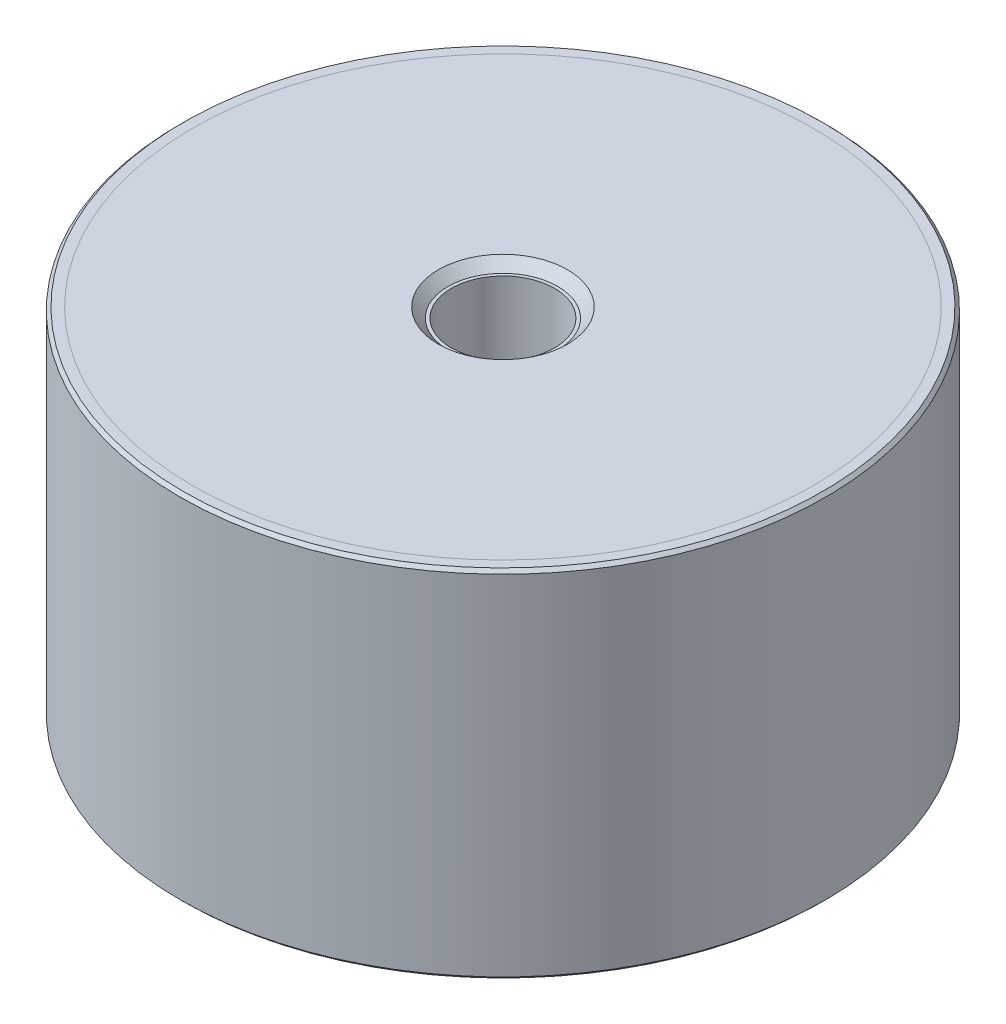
ISO-10303-21;
HEADER;
FILE_DESCRIPTION(('STEP AP214'),'2;1');
FILE_NAME('part.step','',(''),(''),'','','');
FILE_SCHEMA(('AUTOMOTIVE_DESIGN { 1 0 10303 214 1 1 1 1 }'));
ENDSEC;
DATA;
#1=APPLICATION_CONTEXT('core data for automotive mechanical design processes');
#2=APPLICATION_PROTOCOL_DEFINITION('international standard','automotive_design',2000,#1);
#3=PRODUCT_CONTEXT('',#1,'mechanical');
#4=PRODUCT('Part','Part','',(#3));
#5=PRODUCT_RELATED_PRODUCT_CATEGORY('part','',(#4));
#6=PRODUCT_DEFINITION_FORMATION('','',#4);
#7=PRODUCT_DEFINITION_CONTEXT('part definition',#1,'design');
#8=PRODUCT_DEFINITION('design','',#6,#7);
#9=PRODUCT_DEFINITION_SHAPE('','',#8);
#10=(LENGTH_UNIT() NAMED_UNIT(*) SI_UNIT(.MILLI.,.METRE.));
#11=(NAMED_UNIT(*) PLANE_ANGLE_UNIT() SI_UNIT($,.RADIAN.));
#12=(NAMED_UNIT(*) SI_UNIT($,.STERADIAN.) SOLID_ANGLE_UNIT());
#13=UNCERTAINTY_MEASURE_WITH_UNIT(LENGTH_MEASURE(1.E-05),#10,'distance_accuracy_value','');
#14=(GEOMETRIC_REPRESENTATION_CONTEXT(3) GLOBAL_UNCERTAINTY_ASSIGNED_CONTEXT((#13)) GLOBAL_UNIT_ASSIGNED_CONTEXT((#10,
#11,#12)) REPRESENTATION_CONTEXT('',''));
#15=CARTESIAN_POINT('',(0.,0.,0.));
#16=DIRECTION('',(0.,0.,1.));
#17=DIRECTION('',(1.,0.,0.));
#18=AXIS2_PLACEMENT_3D('',#15,#16,#17);
#19=CARTESIAN_POINT('',(0.,-52.,8.));
#20=DIRECTION('',(0.,1.,0.));
#21=DIRECTION('',(0.,0.,1.));
#22=AXIS2_PLACEMENT_3D('',#19,#20,#21);
#23=PLANE('',#22);
#24=CARTESIAN_POINT('',(0.,-52.,0.));
#25=DIRECTION('',(0.,1.,0.));
#26=DIRECTION('',(0.,0.,1.));
#27=AXIS2_PLACEMENT_3D('',#24,#25,#26);
#28=CIRCLE('',#27,8.50000000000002);
#29=CARTESIAN_POINT('',(0.,-52.,8.50000000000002));
#30=VERTEX_POINT('',#29);
#31=EDGE_CURVE('P0_E10',#30,#30,#28,.F.);
#32=ORIENTED_EDGE('',*,*,#31,.T.);
#33=EDGE_LOOP('',(#32));
#34=FACE_BOUND('',#33,.T.);
#35=CARTESIAN_POINT('',(0.,-52.,0.));
#36=DIRECTION('',(0.,1.,0.));
#37=DIRECTION('',(0.,0.,1.));
#38=AXIS2_PLACEMENT_3D('',#35,#36,#37);
#39=CIRCLE('',#38,48.);
#40=CARTESIAN_POINT('',(0.,-52.,48.));
#41=VERTEX_POINT('',#40);
#42=EDGE_CURVE('P0_E25',#41,#41,#39,.T.);
#43=ORIENTED_EDGE('',*,*,#42,.T.);
#44=EDGE_LOOP('',(#43));
#45=FACE_BOUND('',#44,.T.);
#46=ADVANCED_FACE('P0_F14',(#34,#45),#23,.T.);
#47=CARTESIAN_POINT('',(0.,16.0340428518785,0.));
#48=DIRECTION('',(0.,1.,0.));
#49=DIRECTION('',(0.,0.,1.));
#50=AXIS2_PLACEMENT_3D('',#47,#48,#49);
#51=CYLINDRICAL_SURFACE('',#50,48.);
#52=CARTESIAN_POINT('',(0.,-53.5,0.));
#53=DIRECTION('',(0.,1.,0.));
#54=DIRECTION('',(0.,0.,1.));
#55=AXIS2_PLACEMENT_3D('',#52,#53,#54);
#56=CIRCLE('',#55,48.);
#57=CARTESIAN_POINT('',(0.,-53.5,48.));
#58=VERTEX_POINT('',#57);
#59=EDGE_CURVE('P0_E29',#58,#58,#56,.T.);
#60=ORIENTED_EDGE('',*,*,#59,.T.);
#61=EDGE_LOOP('',(#60));
#62=FACE_BOUND('',#61,.T.);
#63=ORIENTED_EDGE('',*,*,#42,.F.);
#64=EDGE_LOOP('',(#63));
#65=FACE_BOUND('',#64,.T.);
#66=ADVANCED_FACE('P0_F35',(#62,#65),#51,.T.);
#67=CARTESIAN_POINT('',(0.,-53.5,48.));
#68=DIRECTION('',(0.,-1.,0.));
#69=DIRECTION('',(0.,0.,-1.));
#70=AXIS2_PLACEMENT_3D('',#67,#68,#69);
#71=PLANE('',#70);
#72=CARTESIAN_POINT('',(0.,-53.5,0.));
#73=DIRECTION('',(0.,-1.,0.));
#74=DIRECTION('',(0.,0.,-1.));
#75=AXIS2_PLACEMENT_3D('',#72,#73,#74);
#76=CIRCLE('',#75,10.);
#77=CARTESIAN_POINT('',(0.,-53.5,-10.));
#78=VERTEX_POINT('',#77);
#79=EDGE_CURVE('P0_E21',#78,#78,#76,.F.);
#80=ORIENTED_EDGE('',*,*,#79,.T.);
#81=EDGE_LOOP('',(#80));
#82=FACE_BOUND('',#81,.T.);
#83=ORIENTED_EDGE('',*,*,#59,.F.);
#84=EDGE_LOOP('',(#83));
#85=FACE_BOUND('',#84,.T.);
#86=ADVANCED_FACE('P0_F38',(#82,#85),#71,.T.);
#87=CARTESIAN_POINT('',(0.,-53.5,0.));
#88=DIRECTION('',(0.,-1.,0.));
#89=DIRECTION('',(0.,0.,-1.));
#90=AXIS2_PLACEMENT_3D('',#87,#88,#89);
#91=CONICAL_SURFACE('',#90,10.,0.785398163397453);
#92=ORIENTED_EDGE('',*,*,#31,.F.);
#93=EDGE_LOOP('',(#92));
#94=FACE_BOUND('',#93,.T.);
#95=ORIENTED_EDGE('',*,*,#79,.F.);
#96=EDGE_LOOP('',(#95));
#97=FACE_BOUND('',#96,.T.);
#98=ADVANCED_FACE('P0_F16',(#94,#97),#91,.F.);
#99=CLOSED_SHELL('',(#46,#66,#86,#98));
#100=MANIFOLD_SOLID_BREP('P0_B1',#99);
#101=CARTESIAN_POINT('',(0.,1.5,8.));
#102=DIRECTION('',(0.,1.,0.));
#103=DIRECTION('',(0.,0.,1.));
#104=AXIS2_PLACEMENT_3D('',#101,#102,#103);
#105=PLANE('',#104);
#106=CARTESIAN_POINT('',(0.,1.5,0.));
#107=DIRECTION('',(0.,1.,0.));
#108=DIRECTION('',(0.,0.,1.));
#109=AXIS2_PLACEMENT_3D('',#106,#107,#108);
#110=CIRCLE('',#109,10.);
#111=CARTESIAN_POINT('',(0.,1.5,10.));
#112=VERTEX_POINT('',#111);
#113=EDGE_CURVE('P1_E10',#112,#112,#110,.F.);
#114=ORIENTED_EDGE('',*,*,#113,.T.);
#115=EDGE_LOOP('',(#114));
#116=FACE_BOUND('',#115,.T.);
#117=CARTESIAN_POINT('',(0.,1.5,0.));
#118=DIRECTION('',(0.,1.,0.));
#119=DIRECTION('',(0.,0.,1.));
#120=AXIS2_PLACEMENT_3D('',#117,#118,#119);
#121=CIRCLE('',#120,48.);
#122=CARTESIAN_POINT('',(0.,1.5,48.));
#123=VERTEX_POINT('',#122);
#124=EDGE_CURVE('P1_E25',#123,#123,#121,.T.);
#125=ORIENTED_EDGE('',*,*,#124,.T.);
#126=EDGE_LOOP('',(#125));
#127=FACE_BOUND('',#126,.T.);
#128=ADVANCED_FACE('P1_F14',(#116,#127),#105,.T.);
#129=CARTESIAN_POINT('',(0.,69.5340428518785,0.));
#130=DIRECTION('',(0.,1.,0.));
#131=DIRECTION('',(0.,0.,1.));
#132=AXIS2_PLACEMENT_3D('',#129,#130,#131);
#133=CYLINDRICAL_SURFACE('',#132,48.);
#134=CARTESIAN_POINT('',(0.,0.,0.));
#135=DIRECTION('',(0.,1.,0.));
#136=DIRECTION('',(0.,0.,1.));
#137=AXIS2_PLACEMENT_3D('',#134,#135,#136);
#138=CIRCLE('',#137,48.);
#139=CARTESIAN_POINT('',(0.,0.,48.));
#140=VERTEX_POINT('',#139);
#141=EDGE_CURVE('P1_E29',#140,#140,#138,.T.);
#142=ORIENTED_EDGE('',*,*,#141,.T.);
#143=EDGE_LOOP('',(#142));
#144=FACE_BOUND('',#143,.T.);
#145=ORIENTED_EDGE('',*,*,#124,.F.);
#146=EDGE_LOOP('',(#145));
#147=FACE_BOUND('',#146,.T.);
#148=ADVANCED_FACE('P1_F35',(#144,#147),#133,.T.);
#149=CARTESIAN_POINT('',(0.,0.,48.));
#150=DIRECTION('',(0.,-1.,0.));
#151=DIRECTION('',(0.,0.,-1.));
#152=AXIS2_PLACEMENT_3D('',#149,#150,#151);
#153=PLANE('',#152);
#154=CARTESIAN_POINT('',(0.,0.,0.));
#155=DIRECTION('',(0.,-1.,0.));
#156=DIRECTION('',(0.,0.,-1.));
#157=AXIS2_PLACEMENT_3D('',#154,#155,#156);
#158=CIRCLE('',#157,8.50000000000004);
#159=CARTESIAN_POINT('',(0.,0.,-8.50000000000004));
#160=VERTEX_POINT('',#159);
#161=EDGE_CURVE('P1_E21',#160,#160,#158,.F.);
#162=ORIENTED_EDGE('',*,*,#161,.T.);
#163=EDGE_LOOP('',(#162));
#164=FACE_BOUND('',#163,.T.);
#165=ORIENTED_EDGE('',*,*,#141,.F.);
#166=EDGE_LOOP('',(#165));
#167=FACE_BOUND('',#166,.T.);
#168=ADVANCED_FACE('P1_F38',(#164,#167),#153,.T.);
#169=CARTESIAN_POINT('',(0.,-0.500000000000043,0.));
#170=DIRECTION('',(0.,1.,0.));
#171=DIRECTION('',(0.,0.,1.));
#172=AXIS2_PLACEMENT_3D('',#169,#170,#171);
#173=CONICAL_SURFACE('',#172,8.,0.785398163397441);
#174=ORIENTED_EDGE('',*,*,#113,.F.);
#175=EDGE_LOOP('',(#174));
#176=FACE_BOUND('',#175,.T.);
#177=ORIENTED_EDGE('',*,*,#161,.F.);
#178=EDGE_LOOP('',(#177));
#179=FACE_BOUND('',#178,.T.);
#180=ADVANCED_FACE('P1_F16',(#176,#179),#173,.F.);
#181=CLOSED_SHELL('',(#128,#148,#168,#180));
#182=MANIFOLD_SOLID_BREP('P1_B1',#181);
#183=CARTESIAN_POINT('',(0.,0.,0.));
#184=DIRECTION('',(0.,1.,0.));
#185=DIRECTION('',(0.,0.,1.));
#186=AXIS2_PLACEMENT_3D('',#183,#184,#185);
#187=PLANE('',#186);
#188=CARTESIAN_POINT('',(0.,0.,0.));
#189=DIRECTION('',(0.,1.,0.));
#190=DIRECTION('',(0.,0.,1.));
#191=AXIS2_PLACEMENT_3D('',#188,#189,#190);
#192=CIRCLE('',#191,8.);
#193=CARTESIAN_POINT('',(0.,0.,8.));
#194=VERTEX_POINT('',#193);
#195=EDGE_CURVE('P2_E46',#194,#194,#192,.T.);
#196=ORIENTED_EDGE('',*,*,#195,.F.);
#197=EDGE_LOOP('',(#196));
#198=FACE_BOUND('',#197,.T.);
#199=CARTESIAN_POINT('',(0.,0.,0.));
#200=DIRECTION('',(0.,1.,0.));
#201=DIRECTION('',(0.,0.,1.));
#202=AXIS2_PLACEMENT_3D('',#199,#200,#201);
#203=CIRCLE('',#202,48.);
#204=CARTESIAN_POINT('',(0.,0.,48.));
#205=VERTEX_POINT('',#204);
#206=EDGE_CURVE('P2_E33',#205,#205,#203,.T.);
#207=ORIENTED_EDGE('',*,*,#206,.T.);
#208=EDGE_LOOP('',(#207));
#209=FACE_BOUND('',#208,.T.);
#210=ADVANCED_FACE('P2_F13',(#198,#209),#187,.T.);
#211=CARTESIAN_POINT('',(0.,65.5134936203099,0.));
#212=DIRECTION('',(0.,1.,0.));
#213=DIRECTION('',(0.,0.,1.));
#214=AXIS2_PLACEMENT_3D('',#211,#212,#213);
#215=CYLINDRICAL_SURFACE('',#214,48.);
#216=CARTESIAN_POINT('',(0.,1.49999999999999,0.));
#217=DIRECTION('',(0.,1.,0.));
#218=DIRECTION('',(0.,0.,1.));
#219=AXIS2_PLACEMENT_3D('',#216,#217,#218);
#220=CIRCLE('',#219,48.);
#221=CARTESIAN_POINT('',(0.,1.49999999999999,48.));
#222=VERTEX_POINT('',#221);
#223=EDGE_CURVE('P2_E36',#222,#222,#220,.T.);
#224=ORIENTED_EDGE('',*,*,#223,.T.);
#225=EDGE_LOOP('',(#224));
#226=FACE_BOUND('',#225,.T.);
#227=ORIENTED_EDGE('',*,*,#206,.F.);
#228=EDGE_LOOP('',(#227));
#229=FACE_BOUND('',#228,.T.);
#230=ADVANCED_FACE('P2_F92',(#226,#229),#215,.F.);
#231=CARTESIAN_POINT('',(0.,1.49999999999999,48.));
#232=DIRECTION('',(0.,1.,0.));
#233=DIRECTION('',(0.,0.,1.));
#234=AXIS2_PLACEMENT_3D('',#231,#232,#233);
#235=PLANE('',#234);
#236=CARTESIAN_POINT('',(0.,1.49999999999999,0.));
#237=DIRECTION('',(0.,1.,0.));
#238=DIRECTION('',(0.,0.,1.));
#239=AXIS2_PLACEMENT_3D('',#236,#237,#238);
#240=CIRCLE('',#239,49.5);
#241=CARTESIAN_POINT('',(0.,1.49999999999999,49.5));
#242=VERTEX_POINT('',#241);
#243=EDGE_CURVE('P2_E9',#242,#242,#240,.T.);
#244=ORIENTED_EDGE('',*,*,#243,.T.);
#245=EDGE_LOOP('',(#244));
#246=FACE_BOUND('',#245,.T.);
#247=ORIENTED_EDGE('',*,*,#223,.F.);
#248=EDGE_LOOP('',(#247));
#249=FACE_BOUND('',#248,.T.);
#250=ADVANCED_FACE('P2_F88',(#246,#249),#235,.T.);
#251=CARTESIAN_POINT('',(0.,65.5134936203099,0.));
#252=DIRECTION('',(0.,1.,0.));
#253=DIRECTION('',(0.,0.,1.));
#254=AXIS2_PLACEMENT_3D('',#251,#252,#253);
#255=CYLINDRICAL_SURFACE('',#254,50.);
#256=CARTESIAN_POINT('',(0.,-53.,0.));
#257=DIRECTION('',(0.,-1.,0.));
#258=DIRECTION('',(0.,0.,-1.));
#259=AXIS2_PLACEMENT_3D('',#256,#257,#258);
#260=CIRCLE('',#259,50.);
#261=CARTESIAN_POINT('',(0.,-53.,-50.));
#262=VERTEX_POINT('',#261);
#263=EDGE_CURVE('P2_E24',#262,#262,#260,.F.);
#264=ORIENTED_EDGE('',*,*,#263,.T.);
#265=EDGE_LOOP('',(#264));
#266=FACE_BOUND('',#265,.T.);
#267=CARTESIAN_POINT('',(0.,0.999999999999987,0.));
#268=DIRECTION('',(0.,1.,0.));
#269=DIRECTION('',(0.,0.,1.));
#270=AXIS2_PLACEMENT_3D('',#267,#268,#269);
#271=CIRCLE('',#270,50.);
#272=CARTESIAN_POINT('',(0.,0.999999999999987,50.));
#273=VERTEX_POINT('',#272);
#274=EDGE_CURVE('P2_E28',#273,#273,#271,.F.);
#275=ORIENTED_EDGE('',*,*,#274,.T.);
#276=EDGE_LOOP('',(#275));
#277=FACE_BOUND('',#276,.T.);
#278=ADVANCED_FACE('P2_F82',(#266,#277),#255,.T.);
#279=CARTESIAN_POINT('',(0.,-53.5,50.));
#280=DIRECTION('',(0.,-1.,0.));
#281=DIRECTION('',(0.,0.,-1.));
#282=AXIS2_PLACEMENT_3D('',#279,#280,#281);
#283=PLANE('',#282);
#284=CARTESIAN_POINT('',(0.,-53.5,0.));
#285=DIRECTION('',(0.,-1.,0.));
#286=DIRECTION('',(0.,0.,-1.));
#287=AXIS2_PLACEMENT_3D('',#284,#285,#286);
#288=CIRCLE('',#287,49.5);
#289=CARTESIAN_POINT('',(0.,-53.5,-49.5));
#290=VERTEX_POINT('',#289);
#291=EDGE_CURVE('P2_E20',#290,#290,#288,.T.);
#292=ORIENTED_EDGE('',*,*,#291,.T.);
#293=EDGE_LOOP('',(#292));
#294=FACE_BOUND('',#293,.T.);
#295=CARTESIAN_POINT('',(0.,-53.5,0.));
#296=DIRECTION('',(0.,1.,0.));
#297=DIRECTION('',(0.,0.,1.));
#298=AXIS2_PLACEMENT_3D('',#295,#296,#297);
#299=CIRCLE('',#298,48.);
#300=CARTESIAN_POINT('',(0.,-53.5,48.));
#301=VERTEX_POINT('',#300);
#302=EDGE_CURVE('P2_E39',#301,#301,#299,.T.);
#303=ORIENTED_EDGE('',*,*,#302,.T.);
#304=EDGE_LOOP('',(#303));
#305=FACE_BOUND('',#304,.T.);
#306=ADVANCED_FACE('P2_F77',(#294,#305),#283,.T.);
#307=CARTESIAN_POINT('',(0.,65.5134936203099,0.));
#308=DIRECTION('',(0.,1.,0.));
#309=DIRECTION('',(0.,0.,1.));
#310=AXIS2_PLACEMENT_3D('',#307,#308,#309);
#311=CYLINDRICAL_SURFACE('',#310,48.);
#312=CARTESIAN_POINT('',(0.,-52.,0.));
#313=DIRECTION('',(0.,1.,0.));
#314=DIRECTION('',(0.,0.,1.));
#315=AXIS2_PLACEMENT_3D('',#312,#313,#314);
#316=CIRCLE('',#315,48.);
#317=CARTESIAN_POINT('',(0.,-52.,48.));
#318=VERTEX_POINT('',#317);
#319=EDGE_CURVE('P2_E42',#318,#318,#316,.T.);
#320=ORIENTED_EDGE('',*,*,#319,.T.);
#321=EDGE_LOOP('',(#320));
#322=FACE_BOUND('',#321,.T.);
#323=ORIENTED_EDGE('',*,*,#302,.F.);
#324=EDGE_LOOP('',(#323));
#325=FACE_BOUND('',#324,.T.);
#326=ADVANCED_FACE('P2_F71',(#322,#325),#311,.F.);
#327=CARTESIAN_POINT('',(0.,-52.,48.));
#328=DIRECTION('',(0.,-1.,0.));
#329=DIRECTION('',(0.,0.,-1.));
#330=AXIS2_PLACEMENT_3D('',#327,#328,#329);
#331=PLANE('',#330);
#332=CARTESIAN_POINT('',(0.,-52.,0.));
#333=DIRECTION('',(0.,-1.,0.));
#334=DIRECTION('',(0.,0.,-1.));
#335=AXIS2_PLACEMENT_3D('',#332,#333,#334);
#336=CIRCLE('',#335,8.);
#337=CARTESIAN_POINT('',(0.,-52.,-8.));
#338=VERTEX_POINT('',#337);
#339=EDGE_CURVE('P2_E52',#338,#338,#336,.T.);
#340=ORIENTED_EDGE('',*,*,#339,.F.);
#341=EDGE_LOOP('',(#340));
#342=FACE_BOUND('',#341,.T.);
#343=ORIENTED_EDGE('',*,*,#319,.F.);
#344=EDGE_LOOP('',(#343));
#345=FACE_BOUND('',#344,.T.);
#346=ADVANCED_FACE('P2_F67',(#342,#345),#331,.T.);
#347=CARTESIAN_POINT('',(0.,-53.,0.));
#348=DIRECTION('',(0.,1.,0.));
#349=DIRECTION('',(0.,0.,1.));
#350=AXIS2_PLACEMENT_3D('',#347,#348,#349);
#351=CONICAL_SURFACE('',#350,50.,0.785398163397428);
#352=ORIENTED_EDGE('',*,*,#291,.F.);
#353=EDGE_LOOP('',(#352));
#354=FACE_BOUND('',#353,.T.);
#355=ORIENTED_EDGE('',*,*,#263,.F.);
#356=EDGE_LOOP('',(#355));
#357=FACE_BOUND('',#356,.T.);
#358=ADVANCED_FACE('P2_F70',(#354,#357),#351,.T.);
#359=CARTESIAN_POINT('',(0.,1.49999999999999,0.));
#360=DIRECTION('',(0.,-1.,0.));
#361=DIRECTION('',(0.,0.,-1.));
#362=AXIS2_PLACEMENT_3D('',#359,#360,#361);
#363=CONICAL_SURFACE('',#362,49.5,0.785398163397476);
#364=ORIENTED_EDGE('',*,*,#274,.F.);
#365=EDGE_LOOP('',(#364));
#366=FACE_BOUND('',#365,.T.);
#367=ORIENTED_EDGE('',*,*,#243,.F.);
#368=EDGE_LOOP('',(#367));
#369=FACE_BOUND('',#368,.T.);
#370=ADVANCED_FACE('P2_F15',(#366,#369),#363,.T.);
#371=CARTESIAN_POINT('',(0.,-14.5,0.));
#372=DIRECTION('',(0.,1.,0.));
#373=DIRECTION('',(0.,0.,1.));
#374=AXIS2_PLACEMENT_3D('',#371,#372,#373);
#375=CYLINDRICAL_SURFACE('',#374,8.);
#376=CARTESIAN_POINT('',(0.,-14.5,0.));
#377=DIRECTION('',(0.,1.,0.));
#378=DIRECTION('',(0.,0.,1.));
#379=AXIS2_PLACEMENT_3D('',#376,#377,#378);
#380=CIRCLE('',#379,8.);
#381=CARTESIAN_POINT('',(0.,-14.5,8.));
#382=VERTEX_POINT('',#381);
#383=EDGE_CURVE('P2_E45',#382,#382,#380,.T.);
#384=CARTESIAN_POINT('',(0.,-14.5,8.));
#385=CARTESIAN_POINT('',(0.,-14.3489583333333,8.));
#386=CARTESIAN_POINT('',(0.,-14.1979166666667,8.));
#387=CARTESIAN_POINT('',(0.,-13.8958333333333,8.));
#388=CARTESIAN_POINT('',(0.,-13.7447916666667,8.));
#389=CARTESIAN_POINT('',(0.,-13.4427083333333,8.));
#390=CARTESIAN_POINT('',(0.,-13.2916666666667,8.));
#391=CARTESIAN_POINT('',(0.,-12.9895833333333,8.));
#392=CARTESIAN_POINT('',(0.,-12.8385416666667,8.));
#393=CARTESIAN_POINT('',(0.,-12.5364583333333,8.));
#394=CARTESIAN_POINT('',(0.,-12.3854166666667,8.));
#395=CARTESIAN_POINT('',(0.,-12.0833333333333,8.));
#396=CARTESIAN_POINT('',(0.,-11.9322916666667,8.));
#397=CARTESIAN_POINT('',(0.,-11.6302083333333,8.));
#398=CARTESIAN_POINT('',(0.,-11.4791666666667,8.));
#399=CARTESIAN_POINT('',(0.,-11.1770833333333,8.));
#400=CARTESIAN_POINT('',(0.,-11.0260416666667,8.));
#401=CARTESIAN_POINT('',(0.,-10.7239583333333,8.));
#402=CARTESIAN_POINT('',(0.,-10.5729166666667,8.));
#403=CARTESIAN_POINT('',(0.,-10.2708333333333,8.));
#404=CARTESIAN_POINT('',(0.,-10.1197916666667,8.));
#405=CARTESIAN_POINT('',(0.,-9.81770833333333,8.));
#406=CARTESIAN_POINT('',(0.,-9.66666666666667,8.));
#407=CARTESIAN_POINT('',(0.,-9.36458333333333,8.));
#408=CARTESIAN_POINT('',(0.,-9.21354166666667,8.));
#409=CARTESIAN_POINT('',(0.,-8.91145833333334,8.));
#410=CARTESIAN_POINT('',(0.,-8.76041666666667,8.));
#411=CARTESIAN_POINT('',(0.,-8.45833333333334,8.));
#412=CARTESIAN_POINT('',(0.,-8.30729166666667,8.));
#413=CARTESIAN_POINT('',(0.,-8.00520833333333,8.));
#414=CARTESIAN_POINT('',(0.,-7.85416666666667,8.));
#415=CARTESIAN_POINT('',(0.,-7.55208333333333,8.));
#416=CARTESIAN_POINT('',(0.,-7.40104166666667,8.));
#417=CARTESIAN_POINT('',(0.,-7.09895833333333,8.));
#418=CARTESIAN_POINT('',(0.,-6.94791666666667,8.));
#419=CARTESIAN_POINT('',(0.,-6.64583333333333,8.));
#420=CARTESIAN_POINT('',(0.,-6.49479166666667,8.));
#421=CARTESIAN_POINT('',(0.,-6.19270833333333,8.));
#422=CARTESIAN_POINT('',(0.,-6.04166666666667,8.));
#423=CARTESIAN_POINT('',(0.,-5.73958333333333,8.));
#424=CARTESIAN_POINT('',(0.,-5.58854166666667,8.));
#425=CARTESIAN_POINT('',(0.,-5.28645833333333,8.));
#426=CARTESIAN_POINT('',(0.,-5.13541666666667,8.));
#427=CARTESIAN_POINT('',(0.,-4.83333333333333,8.));
#428=CARTESIAN_POINT('',(0.,-4.68229166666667,8.));
#429=CARTESIAN_POINT('',(0.,-4.38020833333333,8.));
#430=CARTESIAN_POINT('',(0.,-4.22916666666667,8.));
#431=CARTESIAN_POINT('',(0.,-3.92708333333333,8.));
#432=CARTESIAN_POINT('',(0.,-3.77604166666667,8.));
#433=CARTESIAN_POINT('',(0.,-3.47395833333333,8.));
#434=CARTESIAN_POINT('',(0.,-3.32291666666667,8.));
#435=CARTESIAN_POINT('',(0.,-3.02083333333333,8.));
#436=CARTESIAN_POINT('',(0.,-2.86979166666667,8.));
#437=CARTESIAN_POINT('',(0.,-2.56770833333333,8.));
#438=CARTESIAN_POINT('',(0.,-2.41666666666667,8.));
#439=CARTESIAN_POINT('',(0.,-2.11458333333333,8.));
#440=CARTESIAN_POINT('',(0.,-1.96354166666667,8.));
#441=CARTESIAN_POINT('',(0.,-1.66145833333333,8.));
#442=CARTESIAN_POINT('',(0.,-1.51041666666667,8.));
#443=CARTESIAN_POINT('',(0.,-1.20833333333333,8.));
#444=CARTESIAN_POINT('',(0.,-1.05729166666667,8.));
#445=CARTESIAN_POINT('',(0.,-0.755208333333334,8.));
#446=CARTESIAN_POINT('',(0.,-0.604166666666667,8.));
#447=CARTESIAN_POINT('',(0.,-0.302083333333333,8.));
#448=CARTESIAN_POINT('',(0.,-0.151041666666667,8.));
#449=CARTESIAN_POINT('',(0.,0.,8.));
#450=B_SPLINE_CURVE_WITH_KNOTS('',3,(#384,#385,#386,#387,#388,#389,#390,#391,#392,#393,#394,
#395,#396,#397,#398,#399,#400,#401,#402,#403,#404,#405,#406,#407,#408,#409,#410,#411,#412,#413,
#414,#415,#416,#417,#418,#419,#420,#421,#422,#423,#424,#425,#426,#427,#428,#429,#430,#431,#432,
#433,#434,#435,#436,#437,#438,#439,#440,#441,#442,#443,#444,#445,#446,#447,#448,#449),
.UNSPECIFIED.,.F.,.F.,(4,2,2,2,2,2,2,2,2,2,2,2,2,2,2,2,2,2,2,2,2,2,2,2,2,2,2,2,2,2,2,2,4),(0.,
0.453124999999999,0.906249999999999,1.359375,1.8125,2.265625,2.71875,3.171875,3.625,4.078125,
4.53125,4.984375,5.4375,5.890625,6.34375,6.796875,7.25,7.703125,8.15625,8.609375,9.0625,
9.515625,9.96875,10.421875,10.875,11.328125,11.78125,12.234375,12.6875,13.140625,13.59375,
14.046875,14.5),.UNSPECIFIED.);
#451=EDGE_CURVE('P2_BSEAM108',#382,#194,#450,.T.);
#452=ORIENTED_EDGE('',*,*,#383,.F.);
#453=ORIENTED_EDGE('',*,*,#195,.T.);
#454=ORIENTED_EDGE('',*,*,#451,.T.);
#455=ORIENTED_EDGE('',*,*,#451,.F.);
#456=EDGE_LOOP('',(#452,#454,#453,#455));
#457=FACE_BOUND('',#456,.T.);
#458=ADVANCED_FACE('P2_F108',(#457),#375,.F.);
#459=CARTESIAN_POINT('',(0.,-14.5,0.));
#460=DIRECTION('',(0.,1.,0.));
#461=DIRECTION('',(0.,0.,1.));
#462=AXIS2_PLACEMENT_3D('',#459,#460,#461);
#463=PLANE('',#462);
#464=ORIENTED_EDGE('',*,*,#383,.T.);
#465=EDGE_LOOP('',(#464));
#466=FACE_BOUND('',#465,.T.);
#467=ADVANCED_FACE('P2_F63',(#466),#463,.T.);
#468=CARTESIAN_POINT('',(0.,-37.5,0.));
#469=DIRECTION('',(0.,-1.,0.));
#470=DIRECTION('',(0.,0.,-1.));
#471=AXIS2_PLACEMENT_3D('',#468,#469,#470);
#472=CYLINDRICAL_SURFACE('',#471,8.);
#473=CARTESIAN_POINT('',(0.,-37.5,0.));
#474=DIRECTION('',(0.,-1.,0.));
#475=DIRECTION('',(0.,0.,-1.));
#476=AXIS2_PLACEMENT_3D('',#473,#474,#475);
#477=CIRCLE('',#476,8.);
#478=CARTESIAN_POINT('',(0.,-37.5,-8.));
#479=VERTEX_POINT('',#478);
#480=EDGE_CURVE('P2_E49',#479,#479,#477,.T.);
#481=CARTESIAN_POINT('',(0.,-37.5,-8.));
#482=CARTESIAN_POINT('',(0.,-37.6510416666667,-8.));
#483=CARTESIAN_POINT('',(0.,-37.8020833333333,-8.));
#484=CARTESIAN_POINT('',(0.,-38.1041666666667,-8.));
#485=CARTESIAN_POINT('',(0.,-38.2552083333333,-8.));
#486=CARTESIAN_POINT('',(0.,-38.5572916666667,-8.));
#487=CARTESIAN_POINT('',(0.,-38.7083333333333,-8.));
#488=CARTESIAN_POINT('',(0.,-39.0104166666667,-8.));
#489=CARTESIAN_POINT('',(0.,-39.1614583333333,-8.));
#490=CARTESIAN_POINT('',(0.,-39.4635416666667,-8.));
#491=CARTESIAN_POINT('',(0.,-39.6145833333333,-8.));
#492=CARTESIAN_POINT('',(0.,-39.9166666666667,-8.));
#493=CARTESIAN_POINT('',(0.,-40.0677083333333,-8.));
#494=CARTESIAN_POINT('',(0.,-40.3697916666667,-8.));
#495=CARTESIAN_POINT('',(0.,-40.5208333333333,-8.));
#496=CARTESIAN_POINT('',(0.,-40.8229166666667,-8.));
#497=CARTESIAN_POINT('',(0.,-40.9739583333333,-8.));
#498=CARTESIAN_POINT('',(0.,-41.2760416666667,-8.));
#499=CARTESIAN_POINT('',(0.,-41.4270833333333,-8.));
#500=CARTESIAN_POINT('',(0.,-41.7291666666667,-8.));
#501=CARTESIAN_POINT('',(0.,-41.8802083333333,-8.));
#502=CARTESIAN_POINT('',(0.,-42.1822916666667,-8.));
#503=CARTESIAN_POINT('',(0.,-42.3333333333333,-8.));
#504=CARTESIAN_POINT('',(0.,-42.6354166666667,-8.));
#505=CARTESIAN_POINT('',(0.,-42.7864583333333,-8.));
#506=CARTESIAN_POINT('',(0.,-43.0885416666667,-8.));
#507=CARTESIAN_POINT('',(0.,-43.2395833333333,-8.));
#508=CARTESIAN_POINT('',(0.,-43.5416666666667,-8.));
#509=CARTESIAN_POINT('',(0.,-43.6927083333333,-8.));
#510=CARTESIAN_POINT('',(0.,-43.9947916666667,-8.));
#511=CARTESIAN_POINT('',(0.,-44.1458333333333,-8.));
#512=CARTESIAN_POINT('',(0.,-44.4479166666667,-8.));
#513=CARTESIAN_POINT('',(0.,-44.5989583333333,-8.));
#514=CARTESIAN_POINT('',(0.,-44.9010416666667,-8.));
#515=CARTESIAN_POINT('',(0.,-45.0520833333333,-8.));
#516=CARTESIAN_POINT('',(0.,-45.3541666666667,-8.));
#517=CARTESIAN_POINT('',(0.,-45.5052083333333,-8.));
#518=CARTESIAN_POINT('',(0.,-45.8072916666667,-8.));
#519=CARTESIAN_POINT('',(0.,-45.9583333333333,-8.));
#520=CARTESIAN_POINT('',(0.,-46.2604166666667,-8.));
#521=CARTESIAN_POINT('',(0.,-46.4114583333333,-8.));
#522=CARTESIAN_POINT('',(0.,-46.7135416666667,-8.));
#523=CARTESIAN_POINT('',(0.,-46.8645833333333,-8.));
#524=CARTESIAN_POINT('',(0.,-47.1666666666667,-8.));
#525=CARTESIAN_POINT('',(0.,-47.3177083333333,-8.));
#526=CARTESIAN_POINT('',(0.,-47.6197916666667,-8.));
#527=CARTESIAN_POINT('',(0.,-47.7708333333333,-8.));
#528=CARTESIAN_POINT('',(0.,-48.0729166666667,-8.));
#529=CARTESIAN_POINT('',(0.,-48.2239583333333,-8.));
#530=CARTESIAN_POINT('',(0.,-48.5260416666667,-8.));
#531=CARTESIAN_POINT('',(0.,-48.6770833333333,-8.));
#532=CARTESIAN_POINT('',(0.,-48.9791666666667,-8.));
#533=CARTESIAN_POINT('',(0.,-49.1302083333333,-8.));
#534=CARTESIAN_POINT('',(0.,-49.4322916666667,-8.));
#535=CARTESIAN_POINT('',(0.,-49.5833333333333,-8.));
#536=CARTESIAN_POINT('',(0.,-49.8854166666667,-8.));
#537=CARTESIAN_POINT('',(0.,-50.0364583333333,-8.));
#538=CARTESIAN_POINT('',(0.,-50.3385416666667,-8.));
#539=CARTESIAN_POINT('',(0.,-50.4895833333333,-8.));
#540=CARTESIAN_POINT('',(0.,-50.7916666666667,-8.));
#541=CARTESIAN_POINT('',(0.,-50.9427083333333,-8.));
#542=CARTESIAN_POINT('',(0.,-51.2447916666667,-8.));
#543=CARTESIAN_POINT('',(0.,-51.3958333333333,-8.));
#544=CARTESIAN_POINT('',(0.,-51.6979166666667,-8.));
#545=CARTESIAN_POINT('',(0.,-51.8489583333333,-8.));
#546=CARTESIAN_POINT('',(0.,-52.,-8.));
#547=B_SPLINE_CURVE_WITH_KNOTS('',3,(#481,#482,#483,#484,#485,#486,#487,#488,#489,#490,#491,
#492,#493,#494,#495,#496,#497,#498,#499,#500,#501,#502,#503,#504,#505,#506,#507,#508,#509,#510,
#511,#512,#513,#514,#515,#516,#517,#518,#519,#520,#521,#522,#523,#524,#525,#526,#527,#528,#529,
#530,#531,#532,#533,#534,#535,#536,#537,#538,#539,#540,#541,#542,#543,#544,#545,#546),
.UNSPECIFIED.,.F.,.F.,(4,2,2,2,2,2,2,2,2,2,2,2,2,2,2,2,2,2,2,2,2,2,2,2,2,2,2,2,2,2,2,2,4),(0.,
0.453125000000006,0.906250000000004,1.359375,1.8125,2.265625,2.71875000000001,3.171875,3.625,
4.078125,4.53125,4.984375,5.4375,5.890625,6.34375,6.796875,7.25,7.70312500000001,8.15625,
8.609375,9.0625,9.515625,9.96875,10.421875,10.875,11.328125,11.78125,12.234375,12.6875,
13.140625,13.59375,14.046875,14.5),.UNSPECIFIED.);
#548=EDGE_CURVE('P2_BSEAM60',#479,#338,#547,.T.);
#549=ORIENTED_EDGE('',*,*,#480,.F.);
#550=ORIENTED_EDGE('',*,*,#339,.T.);
#551=ORIENTED_EDGE('',*,*,#548,.T.);
#552=ORIENTED_EDGE('',*,*,#548,.F.);
#553=EDGE_LOOP('',(#549,#551,#550,#552));
#554=FACE_BOUND('',#553,.T.);
#555=ADVANCED_FACE('P2_F60',(#554),#472,.F.);
#556=CARTESIAN_POINT('',(0.,-37.5,0.));
#557=DIRECTION('',(0.,-1.,0.));
#558=DIRECTION('',(0.,0.,-1.));
#559=AXIS2_PLACEMENT_3D('',#556,#557,#558);
#560=PLANE('',#559);
#561=ORIENTED_EDGE('',*,*,#480,.T.);
#562=EDGE_LOOP('',(#561));
#563=FACE_BOUND('',#562,.T.);
#564=ADVANCED_FACE('P2_F58',(#563),#560,.T.);
#565=CLOSED_SHELL('',(#210,#230,#250,#278,#306,#326,#346,#358,#370,#458,#467,#555,#564));
#566=MANIFOLD_SOLID_BREP('P2_B1',#565);
#567=ADVANCED_BREP_SHAPE_REPRESENTATION('',(#18,#100,#182,#566),#14);
#568=SHAPE_DEFINITION_REPRESENTATION(#9,#567);
ENDSEC;
END-ISO-10303-21;
